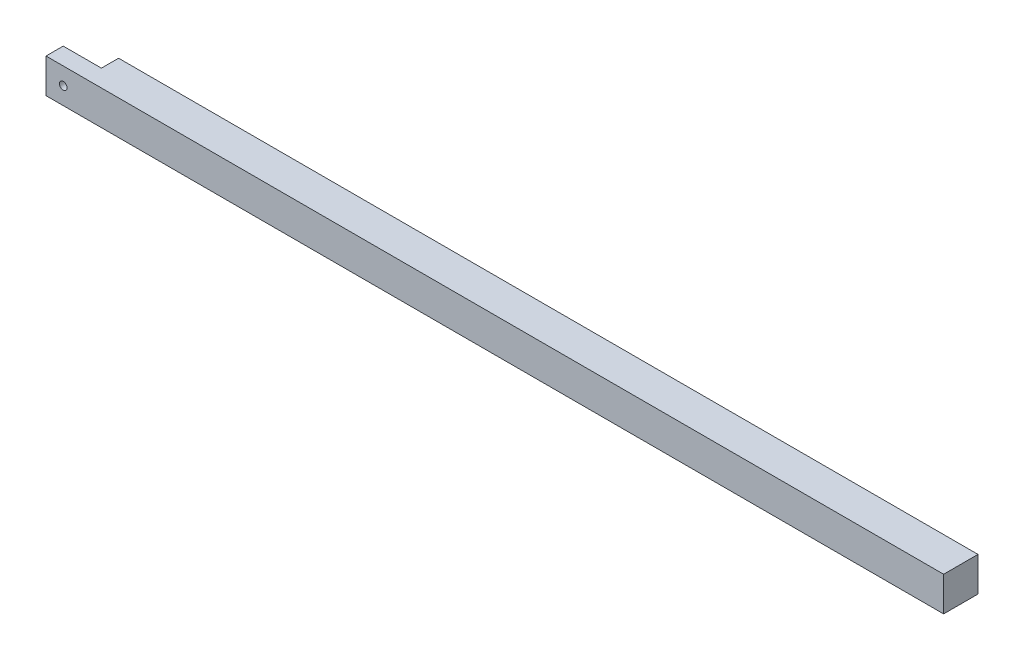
from build123d import *

# Parameters (mm, degrees)
ESQUISSE1_W             = 235
ESQUISSE1_H             = 9
EXTRUSION1_DEPTH        = 9
ESQUISSE2_W             = 10
ESQUISSE2_H             = 9
ENL_V_MAT_EXTRU_1_DEPTH = 4.5
ESQUISSE3_R             = 1
ENL_V_MAT_EXTRU_2_DEPTH = 4.5


with BuildPart() as part:
    # Esquisse1 → Extrusion1 (new body)
    with BuildSketch(Plane.XY):
        with Locations((117.5, 4.5)):
            Rectangle(ESQUISSE1_W, ESQUISSE1_H)
    extrude(amount=EXTRUSION1_DEPTH)

    # Esquisse2 → Enl_v. mat.-Extru.1 (cut)
    with BuildSketch(Plane(origin=(0, 0, 0), x_dir=(-1, 0, 0), z_dir=(0, 0, -1))):
        with Locations((-5, 4.5)):
            Rectangle(ESQUISSE2_W, ESQUISSE2_H)
    extrude(amount=-ENL_V_MAT_EXTRU_1_DEPTH, mode=Mode.SUBTRACT)

    # Esquisse3 → Enl_v. mat.-Extru.2 (cut)
    with BuildSketch(Plane.XY.offset(9)):
        with Locations((4.5, 4.5)):
            Circle(ESQUISSE3_R)
    extrude(amount=-ENL_V_MAT_EXTRU_2_DEPTH, mode=Mode.SUBTRACT)


solid = part.part
